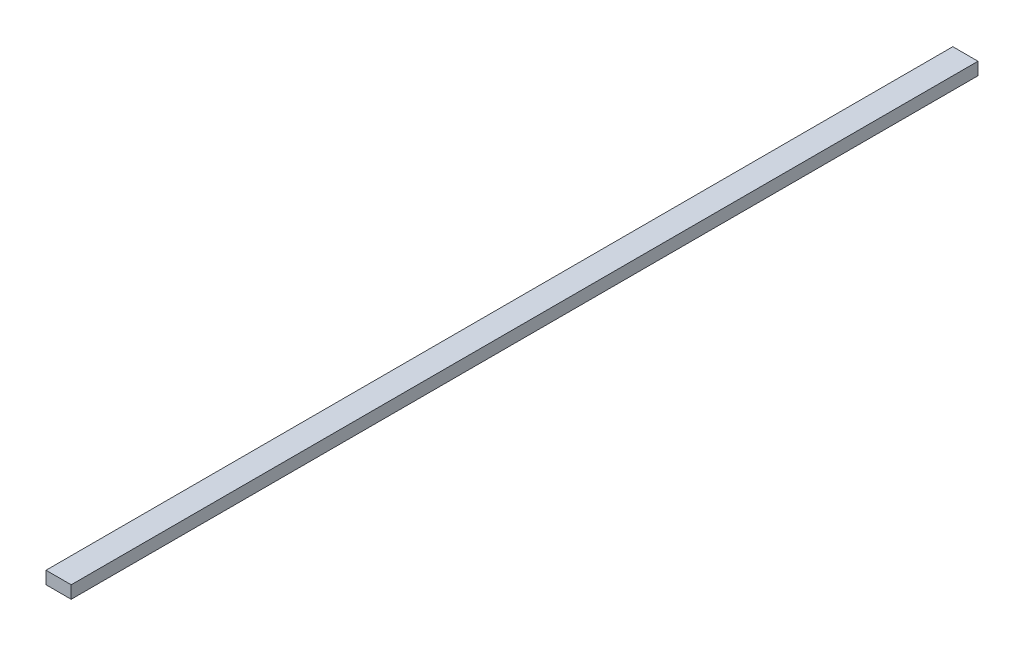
ISO-10303-21;
HEADER;
FILE_DESCRIPTION(('STEP AP214'),'2;1');
FILE_NAME('part.step','',(''),(''),'','','');
FILE_SCHEMA(('AUTOMOTIVE_DESIGN { 1 0 10303 214 1 1 1 1 }'));
ENDSEC;
DATA;
#1=APPLICATION_CONTEXT('core data for automotive mechanical design processes');
#2=APPLICATION_PROTOCOL_DEFINITION('international standard','automotive_design',2000,#1);
#3=PRODUCT_CONTEXT('',#1,'mechanical');
#4=PRODUCT('Part','Part','',(#3));
#5=PRODUCT_RELATED_PRODUCT_CATEGORY('part','',(#4));
#6=PRODUCT_DEFINITION_FORMATION('','',#4);
#7=PRODUCT_DEFINITION_CONTEXT('part definition',#1,'design');
#8=PRODUCT_DEFINITION('design','',#6,#7);
#9=PRODUCT_DEFINITION_SHAPE('','',#8);
#10=(LENGTH_UNIT() NAMED_UNIT(*) SI_UNIT(.MILLI.,.METRE.));
#11=(NAMED_UNIT(*) PLANE_ANGLE_UNIT() SI_UNIT($,.RADIAN.));
#12=(NAMED_UNIT(*) SI_UNIT($,.STERADIAN.) SOLID_ANGLE_UNIT());
#13=UNCERTAINTY_MEASURE_WITH_UNIT(LENGTH_MEASURE(1.E-05),#10,'distance_accuracy_value','');
#14=(GEOMETRIC_REPRESENTATION_CONTEXT(3) GLOBAL_UNCERTAINTY_ASSIGNED_CONTEXT((#13)) GLOBAL_UNIT_ASSIGNED_CONTEXT((#10,
#11,#12)) REPRESENTATION_CONTEXT('',''));
#15=CARTESIAN_POINT('',(0.,0.,0.));
#16=DIRECTION('',(0.,0.,1.));
#17=DIRECTION('',(1.,0.,0.));
#18=AXIS2_PLACEMENT_3D('',#15,#16,#17);
#19=CARTESIAN_POINT('',(-101.6,50.8,0.));
#20=DIRECTION('',(0.,0.,1.));
#21=DIRECTION('',(1.,0.,0.));
#22=AXIS2_PLACEMENT_3D('',#19,#20,#21);
#23=PLANE('',#22);
#24=DIRECTION('',(-1.,0.,0.));
#25=VECTOR('',#24,1.);
#26=CARTESIAN_POINT('',(-101.6,0.,0.));
#27=LINE('',#26,#25);
#28=CARTESIAN_POINT('',(0.,0.,0.));
#29=VERTEX_POINT('',#28);
#30=CARTESIAN_POINT('',(-101.6,0.,0.));
#31=VERTEX_POINT('',#30);
#32=EDGE_CURVE('E96',#29,#31,#27,.T.);
#33=ORIENTED_EDGE('',*,*,#32,.T.);
#34=DIRECTION('',(0.,-1.,0.));
#35=VECTOR('',#34,1.);
#36=CARTESIAN_POINT('',(-101.6,50.8,0.));
#37=LINE('',#36,#35);
#38=CARTESIAN_POINT('',(-101.6,50.8,0.));
#39=VERTEX_POINT('',#38);
#40=EDGE_CURVE('E11',#39,#31,#37,.T.);
#41=ORIENTED_EDGE('',*,*,#40,.F.);
#42=DIRECTION('',(-1.,0.,0.));
#43=VECTOR('',#42,1.);
#44=CARTESIAN_POINT('',(-101.6,50.8,0.));
#45=LINE('',#44,#43);
#46=CARTESIAN_POINT('',(0.,50.8,0.));
#47=VERTEX_POINT('',#46);
#48=EDGE_CURVE('E84',#47,#39,#45,.T.);
#49=ORIENTED_EDGE('',*,*,#48,.F.);
#50=DIRECTION('',(0.,-1.,0.));
#51=VECTOR('',#50,1.);
#52=CARTESIAN_POINT('',(0.,50.8,0.));
#53=LINE('',#52,#51);
#54=EDGE_CURVE('E92',#47,#29,#53,.T.);
#55=ORIENTED_EDGE('',*,*,#54,.T.);
#56=EDGE_LOOP('',(#33,#41,#49,#55));
#57=FACE_BOUND('',#56,.T.);
#58=ADVANCED_FACE('F33',(#57),#23,.F.);
#59=CARTESIAN_POINT('',(-101.6,50.8,3657.6));
#60=DIRECTION('',(1.,0.,0.));
#61=DIRECTION('',(0.,0.,-1.));
#62=AXIS2_PLACEMENT_3D('',#59,#60,#61);
#63=PLANE('',#62);
#64=DIRECTION('',(0.,0.,1.));
#65=VECTOR('',#64,1.);
#66=CARTESIAN_POINT('',(-101.6,0.,3657.6));
#67=LINE('',#66,#65);
#68=CARTESIAN_POINT('',(-101.6,0.,3657.6));
#69=VERTEX_POINT('',#68);
#70=EDGE_CURVE('E88',#31,#69,#67,.T.);
#71=ORIENTED_EDGE('',*,*,#70,.T.);
#72=DIRECTION('',(0.,-1.,0.));
#73=VECTOR('',#72,1.);
#74=CARTESIAN_POINT('',(-101.6,50.8,3657.6));
#75=LINE('',#74,#73);
#76=CARTESIAN_POINT('',(-101.6,50.8,3657.6));
#77=VERTEX_POINT('',#76);
#78=EDGE_CURVE('E41',#77,#69,#75,.T.);
#79=ORIENTED_EDGE('',*,*,#78,.F.);
#80=DIRECTION('',(0.,0.,1.));
#81=VECTOR('',#80,1.);
#82=CARTESIAN_POINT('',(-101.6,50.8,3657.6));
#83=LINE('',#82,#81);
#84=EDGE_CURVE('E79',#39,#77,#83,.T.);
#85=ORIENTED_EDGE('',*,*,#84,.F.);
#86=ORIENTED_EDGE('',*,*,#40,.T.);
#87=EDGE_LOOP('',(#71,#79,#85,#86));
#88=FACE_BOUND('',#87,.T.);
#89=ADVANCED_FACE('F87',(#88),#63,.F.);
#90=CARTESIAN_POINT('',(4.47926813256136E-13,50.8,3657.6));
#91=DIRECTION('',(0.,0.,-1.));
#92=DIRECTION('',(-1.,0.,0.));
#93=AXIS2_PLACEMENT_3D('',#90,#91,#92);
#94=PLANE('',#93);
#95=DIRECTION('',(1.,0.,0.));
#96=VECTOR('',#95,1.);
#97=CARTESIAN_POINT('',(4.47926813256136E-13,0.,3657.6));
#98=LINE('',#97,#96);
#99=CARTESIAN_POINT('',(4.47926813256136E-13,0.,3657.6));
#100=VERTEX_POINT('',#99);
#101=EDGE_CURVE('E66',#69,#100,#98,.T.);
#102=ORIENTED_EDGE('',*,*,#101,.T.);
#103=DIRECTION('',(0.,-1.,0.));
#104=VECTOR('',#103,1.);
#105=CARTESIAN_POINT('',(4.47926813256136E-13,50.8,3657.6));
#106=LINE('',#105,#104);
#107=CARTESIAN_POINT('',(4.47926813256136E-13,50.8,3657.6));
#108=VERTEX_POINT('',#107);
#109=EDGE_CURVE('E89',#108,#100,#106,.T.);
#110=ORIENTED_EDGE('',*,*,#109,.F.);
#111=DIRECTION('',(1.,0.,0.));
#112=VECTOR('',#111,1.);
#113=CARTESIAN_POINT('',(4.47926813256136E-13,50.8,3657.6));
#114=LINE('',#113,#112);
#115=EDGE_CURVE('E82',#77,#108,#114,.T.);
#116=ORIENTED_EDGE('',*,*,#115,.F.);
#117=ORIENTED_EDGE('',*,*,#78,.T.);
#118=EDGE_LOOP('',(#102,#110,#116,#117));
#119=FACE_BOUND('',#118,.T.);
#120=ADVANCED_FACE('F90',(#119),#94,.F.);
#121=CARTESIAN_POINT('',(0.,50.8,0.));
#122=DIRECTION('',(-1.,0.,0.));
#123=DIRECTION('',(0.,0.,1.));
#124=AXIS2_PLACEMENT_3D('',#121,#122,#123);
#125=PLANE('',#124);
#126=DIRECTION('',(0.,0.,-1.));
#127=VECTOR('',#126,1.);
#128=CARTESIAN_POINT('',(0.,0.,0.));
#129=LINE('',#128,#127);
#130=EDGE_CURVE('E72',#100,#29,#129,.T.);
#131=ORIENTED_EDGE('',*,*,#130,.T.);
#132=ORIENTED_EDGE('',*,*,#54,.F.);
#133=DIRECTION('',(0.,0.,-1.));
#134=VECTOR('',#133,1.);
#135=CARTESIAN_POINT('',(0.,50.8,0.));
#136=LINE('',#135,#134);
#137=EDGE_CURVE('E49',#108,#47,#136,.T.);
#138=ORIENTED_EDGE('',*,*,#137,.F.);
#139=ORIENTED_EDGE('',*,*,#109,.T.);
#140=EDGE_LOOP('',(#131,#132,#138,#139));
#141=FACE_BOUND('',#140,.T.);
#142=ADVANCED_FACE('F103',(#141),#125,.F.);
#143=CARTESIAN_POINT('',(0.,50.8,0.));
#144=DIRECTION('',(0.,-1.,0.));
#145=DIRECTION('',(0.,0.,-1.));
#146=AXIS2_PLACEMENT_3D('',#143,#144,#145);
#147=PLANE('',#146);
#148=ORIENTED_EDGE('',*,*,#48,.T.);
#149=ORIENTED_EDGE('',*,*,#84,.T.);
#150=ORIENTED_EDGE('',*,*,#115,.T.);
#151=ORIENTED_EDGE('',*,*,#137,.T.);
#152=EDGE_LOOP('',(#148,#149,#150,#151));
#153=FACE_BOUND('',#152,.T.);
#154=ADVANCED_FACE('F80',(#153),#147,.F.);
#155=CARTESIAN_POINT('',(0.,0.,0.));
#156=DIRECTION('',(0.,-1.,0.));
#157=DIRECTION('',(0.,0.,-1.));
#158=AXIS2_PLACEMENT_3D('',#155,#156,#157);
#159=PLANE('',#158);
#160=ORIENTED_EDGE('',*,*,#32,.F.);
#161=ORIENTED_EDGE('',*,*,#130,.F.);
#162=ORIENTED_EDGE('',*,*,#101,.F.);
#163=ORIENTED_EDGE('',*,*,#70,.F.);
#164=EDGE_LOOP('',(#160,#161,#162,#163));
#165=FACE_BOUND('',#164,.T.);
#166=ADVANCED_FACE('F106',(#165),#159,.T.);
#167=CLOSED_SHELL('',(#58,#89,#120,#142,#154,#166));
#168=MANIFOLD_SOLID_BREP('B2',#167);
#169=ADVANCED_BREP_SHAPE_REPRESENTATION('',(#18,#168),#14);
#170=SHAPE_DEFINITION_REPRESENTATION(#9,#169);
ENDSEC;
END-ISO-10303-21;
